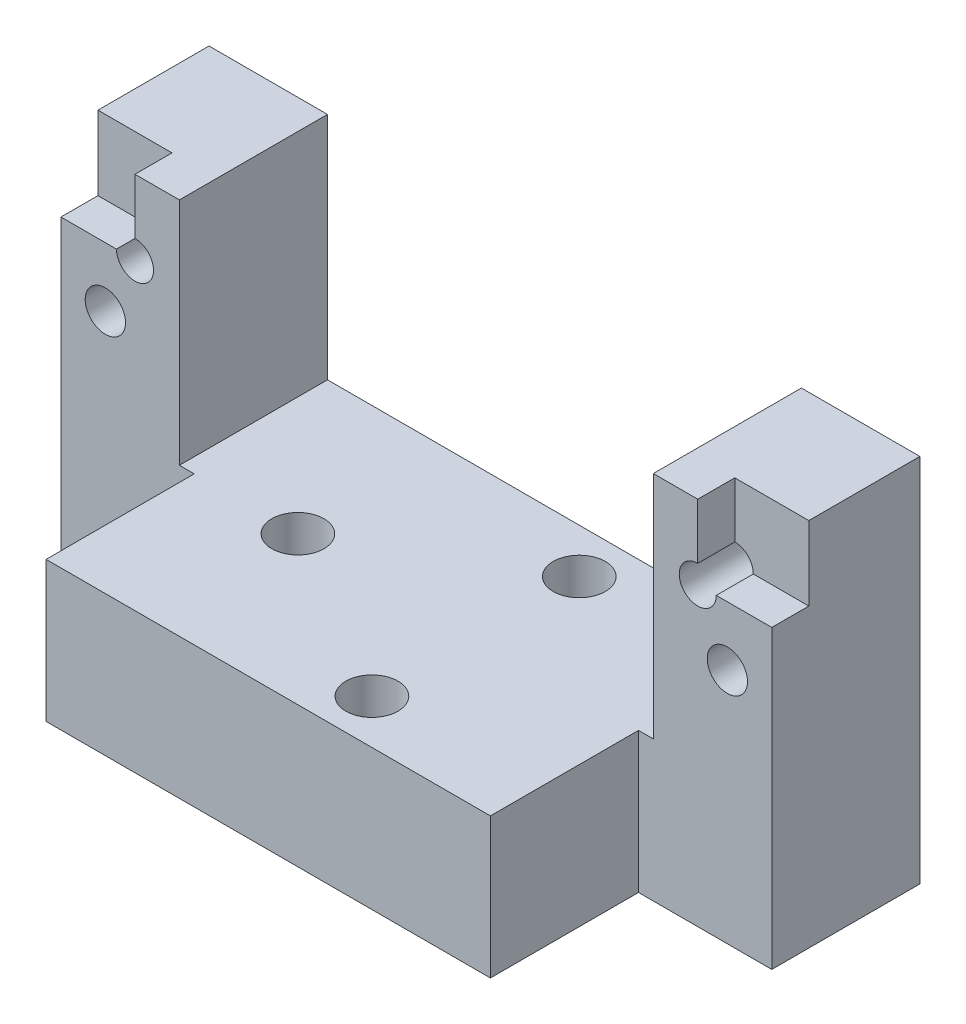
from build123d import *

# Parameters (mm, degrees)
SKETCH1_W             = 60.96
SKETCH1_H             = 31.75
BOSS_EXTRUDE1_DEPTH   = 12.7
CUT_EXTRUDE2_REACH    = 44.734
SKETCH4_W             = 40.64
SKETCH4_H             = 19.7104
SKETCH5_W             = 11.43
SKETCH5_H             = 31.75
CUT_EXTRUDE3_DEPTH    = 12.7
SKETCH6_W             = 6.35
SKETCH6_H             = 6.35
CUT_EXTRUDE4_DEPTH    = 3.175
SKETCH7_R             = 1.5875
CUT_EXTRUDE5_DEPTH    = 6.35
F_8_32_TAPPED_HOLE1_D = 3.4544
CUT_EXTRUDE6_REACH    = 40.455
SKETCH10_R            = 2.2352


with BuildPart() as part:
    # Sketch1 → Boss-Extrude1 (new, symmetric)
    with BuildSketch(Plane.XY):
        Rectangle(SKETCH1_W, SKETCH1_H)
    extrude(amount=BOSS_EXTRUDE1_DEPTH, both=True)

    # Sketch4 → Cut-Extrude2 (cut, up to next)
    with BuildSketch(Plane.XY.offset(12.7), mode=Mode.PRIVATE) as cut_extrude2_sk1:
        with Locations((0, 6.0198)):
            Rectangle(SKETCH4_W, SKETCH4_H)
    cut_extrude2_tool1 = extrude(cut_extrude2_sk1.sketch, amount=-CUT_EXTRUDE2_REACH, mode=Mode.PRIVATE) & part.part
    add(cut_extrude2_tool1.solids().sort_by_distance((0, 6.0198, 12.7))[0], mode=Mode.SUBTRACT)

    # Sketch5 → Cut-Extrude3 (cut)
    with BuildSketch(Plane.XY.offset(12.7)):
        with Locations((24.765, 0)):
            Rectangle(SKETCH5_W, SKETCH5_H)
    cut_extrude3 = extrude(amount=-CUT_EXTRUDE3_DEPTH, mode=Mode.SUBTRACT)

    # Mirror2: Cut-Extrude3 across plane
    add(cut_extrude3.mirror(Plane(origin=(0, 0, 0), x_dir=(0, 0, 1), z_dir=(1, 0, 0))), mode=Mode.SUBTRACT)

    # Sketch6 → Cut-Extrude4 (cut)
    with BuildSketch(Plane.XY):
        with Locations((27.305, 12.7)):
            Rectangle(SKETCH6_W, SKETCH6_H)
    cut_extrude4 = extrude(amount=-CUT_EXTRUDE4_DEPTH, mode=Mode.SUBTRACT)

    # Sketch7 → Cut-Extrude5 (cut)
    with BuildSketch(Plane.XY):
        with Locations((24.13, 9.525)):
            Circle(SKETCH7_R)
    cut_extrude5 = extrude(amount=-CUT_EXTRUDE5_DEPTH, mode=Mode.SUBTRACT)

    # 8-32 Tapped Hole1 (through all)
    with Locations(Plane.XY):
        with Locations((26.67, 4.445)):
            f_8_32_tapped_hole1 = Hole(F_8_32_TAPPED_HOLE1_D / 2)

    # Sketch10 → Cut-Extrude6 (cut, up to next)
    with BuildSketch(Plane(origin=(0, -3.8354, 0), x_dir=(1, 0, 0), z_dir=(0, 1, 0)), mode=Mode.PRIVATE) as cut_extrude6_sk1:
        with Locations(Location((5.08, 8.89, 0), (0, 0, 270))):
            Circle(SKETCH10_R)
    cut_extrude6_tool1 = extrude(cut_extrude6_sk1.sketch, amount=-CUT_EXTRUDE6_REACH, mode=Mode.PRIVATE) & part.part
    # Sketch10 → Cut-Extrude6 (cut, up to next)
    with BuildSketch(Plane(origin=(0, -3.8354, 0), x_dir=(1, 0, 0), z_dir=(0, 1, 0)), mode=Mode.PRIVATE) as cut_extrude6_sk2:
        with Locations(Location((5.08, -8.89, 0), (0, 0, 270))):
            Circle(SKETCH10_R)
    cut_extrude6_tool2 = extrude(cut_extrude6_sk2.sketch, amount=-CUT_EXTRUDE6_REACH, mode=Mode.PRIVATE) & part.part
    # Sketch10 → Cut-Extrude6 (cut, up to next)
    with BuildSketch(Plane(origin=(0, -3.8354, 0), x_dir=(1, 0, 0), z_dir=(0, 1, 0)), mode=Mode.PRIVATE) as cut_extrude6_sk3:
        with Locations(Location((-10.16, 0, 0), (0, 0, 270))):
            Circle(SKETCH10_R)
    cut_extrude6_tool3 = extrude(cut_extrude6_sk3.sketch, amount=-CUT_EXTRUDE6_REACH, mode=Mode.PRIVATE) & part.part
    add(cut_extrude6_tool1.solids().sort_by_distance((5.08, -3.8354, -8.89))[0], mode=Mode.SUBTRACT)
    add(cut_extrude6_tool2.solids().sort_by_distance((5.08, -3.8354, 8.89))[0], mode=Mode.SUBTRACT)
    add(cut_extrude6_tool3.solids().sort_by_distance((-10.16, -3.8354, 0))[0], mode=Mode.SUBTRACT)

    # Mirror3: Cut-Extrude4, Cut-Extrude5, 8-32 Tapped Hole1 across plane
    add(cut_extrude4.mirror(Plane(origin=(0, 0, 0), x_dir=(0, 0, 1), z_dir=(1, 0, 0))), mode=Mode.SUBTRACT)
    add(cut_extrude5.mirror(Plane(origin=(0, 0, 0), x_dir=(0, 0, 1), z_dir=(1, 0, 0))), mode=Mode.SUBTRACT)
    add(f_8_32_tapped_hole1.mirror(Plane(origin=(0, 0, 0), x_dir=(0, 0, 1), z_dir=(1, 0, 0))), mode=Mode.SUBTRACT)


solid = part.part
